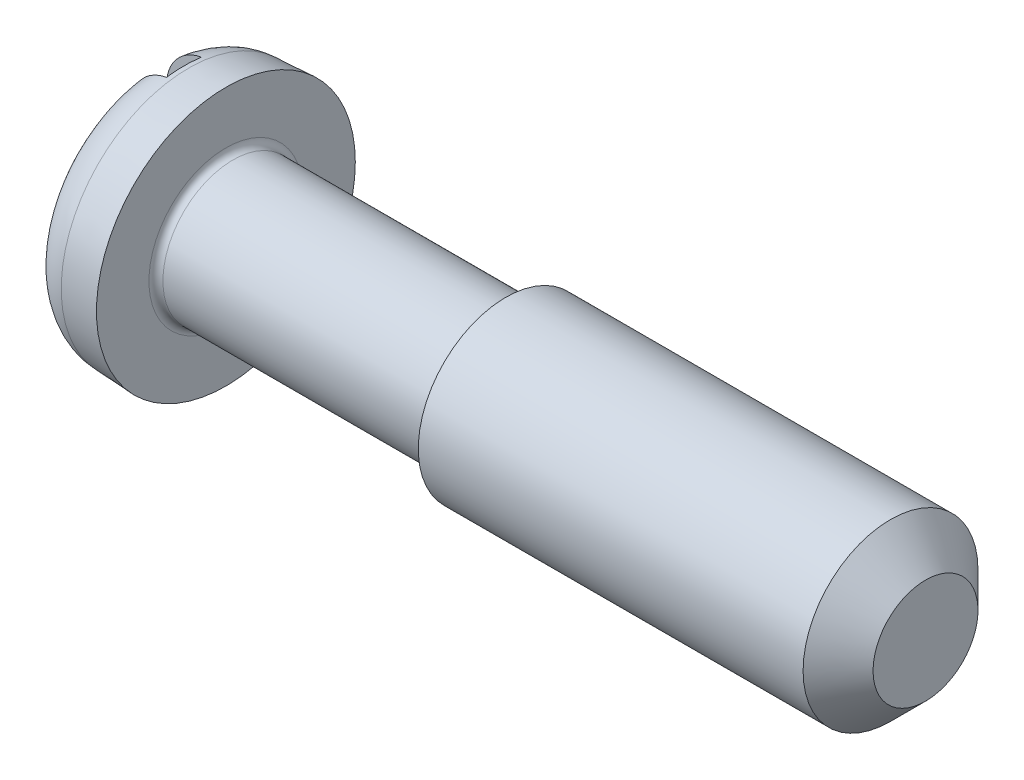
ISO-10303-21;
HEADER;
FILE_DESCRIPTION(('STEP AP214'),'2;1');
FILE_NAME('part.step','',(''),(''),'','','');
FILE_SCHEMA(('AUTOMOTIVE_DESIGN { 1 0 10303 214 1 1 1 1 }'));
ENDSEC;
DATA;
#1=APPLICATION_CONTEXT('core data for automotive mechanical design processes');
#2=APPLICATION_PROTOCOL_DEFINITION('international standard','automotive_design',2000,#1);
#3=PRODUCT_CONTEXT('',#1,'mechanical');
#4=PRODUCT('Part','Part','',(#3));
#5=PRODUCT_RELATED_PRODUCT_CATEGORY('part','',(#4));
#6=PRODUCT_DEFINITION_FORMATION('','',#4);
#7=PRODUCT_DEFINITION_CONTEXT('part definition',#1,'design');
#8=PRODUCT_DEFINITION('design','',#6,#7);
#9=PRODUCT_DEFINITION_SHAPE('','',#8);
#10=(LENGTH_UNIT() NAMED_UNIT(*) SI_UNIT(.MILLI.,.METRE.));
#11=(NAMED_UNIT(*) PLANE_ANGLE_UNIT() SI_UNIT($,.RADIAN.));
#12=(NAMED_UNIT(*) SI_UNIT($,.STERADIAN.) SOLID_ANGLE_UNIT());
#13=UNCERTAINTY_MEASURE_WITH_UNIT(LENGTH_MEASURE(1.E-05),#10,'distance_accuracy_value','');
#14=(GEOMETRIC_REPRESENTATION_CONTEXT(3) GLOBAL_UNCERTAINTY_ASSIGNED_CONTEXT((#13)) GLOBAL_UNIT_ASSIGNED_CONTEXT((#10,
#11,#12)) REPRESENTATION_CONTEXT('',''));
#15=CARTESIAN_POINT('',(0.,0.,0.));
#16=DIRECTION('',(0.,0.,1.));
#17=DIRECTION('',(1.,0.,0.));
#18=AXIS2_PLACEMENT_3D('',#15,#16,#17);
#19=CARTESIAN_POINT('',(11.1000000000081,0.,0.));
#20=DIRECTION('',(-1.,0.,0.));
#21=DIRECTION('',(0.,0.,1.));
#22=AXIS2_PLACEMENT_3D('',#19,#20,#21);
#23=CYLINDRICAL_SURFACE('',#22,1.);
#24=CARTESIAN_POINT('',(1.2,0.,0.));
#25=DIRECTION('',(1.,0.,0.));
#26=DIRECTION('',(0.,0.,-1.));
#27=AXIS2_PLACEMENT_3D('',#24,#25,#26);
#28=CIRCLE('',#27,1.);
#29=CARTESIAN_POINT('',(1.2,0.,-1.));
#30=VERTEX_POINT('',#29);
#31=EDGE_CURVE('E214',#30,#30,#28,.T.);
#32=ORIENTED_EDGE('',*,*,#31,.T.);
#33=EDGE_LOOP('',(#32));
#34=FACE_BOUND('',#33,.T.);
#35=CARTESIAN_POINT('',(4.999999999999,0.,0.));
#36=DIRECTION('',(1.,0.,0.));
#37=DIRECTION('',(0.,0.,-1.));
#38=AXIS2_PLACEMENT_3D('',#35,#36,#37);
#39=CIRCLE('',#38,1.);
#40=CARTESIAN_POINT('',(4.999999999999,0.,-1.));
#41=VERTEX_POINT('',#40);
#42=EDGE_CURVE('E209',#41,#41,#39,.F.);
#43=ORIENTED_EDGE('',*,*,#42,.T.);
#44=EDGE_LOOP('',(#43));
#45=FACE_BOUND('',#44,.T.);
#46=ADVANCED_FACE('F43',(#34,#45),#23,.T.);
#47=CARTESIAN_POINT('',(0.,0.,0.));
#48=DIRECTION('',(1.,0.,0.));
#49=DIRECTION('',(0.,0.,-1.));
#50=AXIS2_PLACEMENT_3D('',#47,#48,#49);
#51=PLANE('',#50);
#52=CARTESIAN_POINT('',(0.,0.,0.));
#53=DIRECTION('',(1.,0.,0.));
#54=DIRECTION('',(0.,0.,-1.));
#55=AXIS2_PLACEMENT_3D('',#52,#53,#54);
#56=CIRCLE('',#55,1.22297270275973);
#57=CARTESIAN_POINT('',(0.,-1.19714753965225,0.25));
#58=VERTEX_POINT('',#57);
#59=CARTESIAN_POINT('',(0.,1.19714753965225,0.25));
#60=VERTEX_POINT('',#59);
#61=EDGE_CURVE('E115',#58,#60,#56,.F.);
#62=ORIENTED_EDGE('',*,*,#61,.T.);
#63=DIRECTION('',(0.,1.,0.));
#64=VECTOR('',#63,1.);
#65=CARTESIAN_POINT('',(0.,-1.85,0.25));
#66=LINE('',#65,#64);
#67=EDGE_CURVE('E63',#58,#60,#66,.T.);
#68=ORIENTED_EDGE('',*,*,#67,.F.);
#69=EDGE_LOOP('',(#62,#68));
#70=FACE_BOUND('',#69,.T.);
#71=ADVANCED_FACE('F147',(#70),#51,.F.);
#72=CARTESIAN_POINT('',(1.1,0.,0.));
#73=DIRECTION('',(1.,0.,0.));
#74=DIRECTION('',(0.,0.,-1.));
#75=AXIS2_PLACEMENT_3D('',#72,#73,#74);
#76=PLANE('',#75);
#77=CARTESIAN_POINT('',(1.1,0.,0.));
#78=DIRECTION('',(1.,0.,0.));
#79=DIRECTION('',(0.,0.,-1.));
#80=AXIS2_PLACEMENT_3D('',#77,#78,#79);
#81=CIRCLE('',#80,1.1);
#82=CARTESIAN_POINT('',(1.1,0.,-1.1));
#83=VERTEX_POINT('',#82);
#84=EDGE_CURVE('E51',#83,#83,#81,.F.);
#85=ORIENTED_EDGE('',*,*,#84,.T.);
#86=EDGE_LOOP('',(#85));
#87=FACE_BOUND('',#86,.T.);
#88=CARTESIAN_POINT('',(1.1,0.,0.));
#89=DIRECTION('',(1.,0.,0.));
#90=DIRECTION('',(0.,0.,-1.));
#91=AXIS2_PLACEMENT_3D('',#88,#89,#90);
#92=CIRCLE('',#91,1.85);
#93=CARTESIAN_POINT('',(1.1,0.,-1.85));
#94=VERTEX_POINT('',#93);
#95=EDGE_CURVE('E119',#94,#94,#92,.T.);
#96=ORIENTED_EDGE('',*,*,#95,.T.);
#97=EDGE_LOOP('',(#96));
#98=FACE_BOUND('',#97,.T.);
#99=ADVANCED_FACE('F155',(#87,#98),#76,.T.);
#100=CARTESIAN_POINT('',(1.1,0.,0.));
#101=DIRECTION('',(1.,0.,0.));
#102=DIRECTION('',(0.,0.,-1.));
#103=AXIS2_PLACEMENT_3D('',#100,#101,#102);
#104=CONICAL_SURFACE('',#103,1.85,0.05235987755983);
#105=CARTESIAN_POINT('',(0.568598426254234,0.,0.));
#106=DIRECTION('',(1.,0.,0.));
#107=DIRECTION('',(0.,0.,-1.));
#108=AXIS2_PLACEMENT_3D('',#105,#106,#107);
#109=CIRCLE('',#108,1.82215042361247);
#110=CARTESIAN_POINT('',(0.568598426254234,0.,-1.82215042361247));
#111=VERTEX_POINT('',#110);
#112=EDGE_CURVE('E116',#111,#111,#109,.T.);
#113=ORIENTED_EDGE('',*,*,#112,.T.);
#114=EDGE_LOOP('',(#113));
#115=FACE_BOUND('',#114,.T.);
#116=ORIENTED_EDGE('',*,*,#95,.F.);
#117=EDGE_LOOP('',(#116));
#118=FACE_BOUND('',#117,.T.);
#119=ADVANCED_FACE('F164',(#115,#118),#104,.T.);
#120=CARTESIAN_POINT('',(0.,1.19714753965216,-0.25));
#121=VERTEX_POINT('',#120);
#122=CARTESIAN_POINT('',(0.,-1.19714753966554,-0.25));
#123=VERTEX_POINT('',#122);
#124=EDGE_CURVE('E114',#121,#123,#56,.F.);
#125=ORIENTED_EDGE('',*,*,#124,.T.);
#126=DIRECTION('',(0.,1.,0.));
#127=VECTOR('',#126,1.);
#128=CARTESIAN_POINT('',(0.,-1.85,-0.25));
#129=LINE('',#128,#127);
#130=EDGE_CURVE('E88',#123,#121,#129,.T.);
#131=ORIENTED_EDGE('',*,*,#130,.T.);
#132=EDGE_LOOP('',(#125,#131));
#133=FACE_BOUND('',#132,.T.);
#134=ADVANCED_FACE('F157',(#133),#51,.F.);
#135=CARTESIAN_POINT('',(0.6,0.,0.));
#136=DIRECTION('',(1.,0.,0.));
#137=DIRECTION('',(0.,0.,-1.));
#138=AXIS2_PLACEMENT_3D('',#135,#136,#137);
#139=TOROIDAL_SURFACE('',#138,1.22297270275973,0.6);
#140=CARTESIAN_POINT('',(0.277676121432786,-1.7108741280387,0.25));
#141=CARTESIAN_POINT('',(0.24920481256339,-1.6925458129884,0.25));
#142=CARTESIAN_POINT('',(0.222271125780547,-1.67177922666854,0.25));
#143=CARTESIAN_POINT('',(0.172264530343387,-1.62598662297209,0.25));
#144=CARTESIAN_POINT('',(0.149196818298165,-1.60095496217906,0.25));
#145=CARTESIAN_POINT('',(0.107602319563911,-1.54740517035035,0.25));
#146=CARTESIAN_POINT('',(0.0890710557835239,-1.51889051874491,0.25));
#147=CARTESIAN_POINT('',(0.0570138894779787,-1.4591876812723,0.25));
#148=CARTESIAN_POINT('',(0.0434867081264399,-1.42800018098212,0.25));
#149=CARTESIAN_POINT('',(0.0216547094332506,-1.36351517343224,0.25));
#150=CARTESIAN_POINT('',(0.0134012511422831,-1.33020029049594,0.25));
#151=CARTESIAN_POINT('',(0.00249748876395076,-1.26266597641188,0.25));
#152=CARTESIAN_POINT('',(-0.000152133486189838,-1.22844643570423,0.25));
#153=CARTESIAN_POINT('',(0.000168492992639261,-1.15941784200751,0.25));
#154=CARTESIAN_POINT('',(0.00324086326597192,-1.12460927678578,0.25));
#155=CARTESIAN_POINT('',(0.0150601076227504,-1.05597025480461,0.25));
#156=CARTESIAN_POINT('',(0.0238075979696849,-1.02213990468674,0.25));
#157=CARTESIAN_POINT('',(0.0469341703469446,-0.955656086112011,0.25));
#158=CARTESIAN_POINT('',(0.0614286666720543,-0.92304275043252,0.25));
#159=CARTESIAN_POINT('',(0.0956106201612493,-0.860656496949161,0.25));
#160=CARTESIAN_POINT('',(0.115298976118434,-0.830884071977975,0.25));
#161=CARTESIAN_POINT('',(0.159653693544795,-0.774618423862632,0.25));
#162=CARTESIAN_POINT('',(0.1843863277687,-0.74817735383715,0.25));
#163=CARTESIAN_POINT('',(0.23801750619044,-0.699905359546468,0.25));
#164=CARTESIAN_POINT('',(0.266916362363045,-0.678074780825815,0.25));
#165=CARTESIAN_POINT('',(0.327537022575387,-0.640227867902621,0.25));
#166=CARTESIAN_POINT('',(0.359193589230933,-0.624107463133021,0.25));
#167=CARTESIAN_POINT('',(0.424902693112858,-0.597880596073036,0.25));
#168=CARTESIAN_POINT('',(0.458953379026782,-0.587769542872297,0.25));
#169=CARTESIAN_POINT('',(0.52587483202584,-0.57464853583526,0.25));
#170=CARTESIAN_POINT('',(0.5586563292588,-0.571183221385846,0.25));
#171=CARTESIAN_POINT('',(0.624305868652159,-0.570167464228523,0.25));
#172=CARTESIAN_POINT('',(0.657173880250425,-0.572615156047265,0.25));
#173=CARTESIAN_POINT('',(0.72016913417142,-0.582973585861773,0.25));
#174=CARTESIAN_POINT('',(0.750347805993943,-0.590577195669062,0.25));
#175=CARTESIAN_POINT('',(0.80908254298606,-0.610548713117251,0.25));
#176=CARTESIAN_POINT('',(0.83763821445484,-0.622917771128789,0.25));
#177=CARTESIAN_POINT('',(0.893573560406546,-0.652503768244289,0.25));
#178=CARTESIAN_POINT('',(0.920861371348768,-0.669893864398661,0.25));
#179=CARTESIAN_POINT('',(0.972404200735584,-0.708698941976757,0.25));
#180=CARTESIAN_POINT('',(0.996658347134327,-0.730115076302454,0.25));
#181=CARTESIAN_POINT('',(1.04334267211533,-0.778139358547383,0.25));
#182=CARTESIAN_POINT('',(1.06549499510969,-0.805018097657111,0.25));
#183=CARTESIAN_POINT('',(1.10516996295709,-0.862001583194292,0.25));
#184=CARTESIAN_POINT('',(1.1226916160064,-0.892107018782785,0.25));
#185=CARTESIAN_POINT('',(1.15319618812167,-0.955916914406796,0.25));
#186=CARTESIAN_POINT('',(1.16598754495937,-0.989713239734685,0.25));
#187=CARTESIAN_POINT('',(1.18568560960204,-1.05898159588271,0.25));
#188=CARTESIAN_POINT('',(1.19259228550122,-1.0944536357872,0.25));
#189=CARTESIAN_POINT('',(1.20023971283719,-1.16588569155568,0.25));
#190=CARTESIAN_POINT('',(1.20101019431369,-1.20184250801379,0.25));
#191=CARTESIAN_POINT('',(1.19637006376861,-1.27335655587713,0.25));
#192=CARTESIAN_POINT('',(1.19096006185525,-1.30891382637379,0.25));
#193=CARTESIAN_POINT('',(1.17423093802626,-1.37783579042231,0.25));
#194=CARTESIAN_POINT('',(1.16303566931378,-1.41123054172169,0.25));
#195=CARTESIAN_POINT('',(1.13508454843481,-1.47560670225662,0.25));
#196=CARTESIAN_POINT('',(1.11832929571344,-1.50658837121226,0.25));
#197=CARTESIAN_POINT('',(1.0801023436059,-1.56460609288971,0.25));
#198=CARTESIAN_POINT('',(1.05873124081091,-1.59170844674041,0.25));
#199=CARTESIAN_POINT('',(1.01168085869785,-1.64187311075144,0.25));
#200=CARTESIAN_POINT('',(0.986001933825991,-1.66493575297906,0.25));
#201=CARTESIAN_POINT('',(0.931472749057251,-1.70601884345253,0.25));
#202=CARTESIAN_POINT('',(0.902674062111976,-1.72410776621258,0.25));
#203=CARTESIAN_POINT('',(0.842428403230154,-1.75514180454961,0.25));
#204=CARTESIAN_POINT('',(0.810981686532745,-1.76808741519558,0.25));
#205=CARTESIAN_POINT('',(0.74664239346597,-1.78835404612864,0.25));
#206=CARTESIAN_POINT('',(0.713765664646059,-1.795725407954,0.25));
#207=CARTESIAN_POINT('',(0.647230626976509,-1.80481985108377,0.25));
#208=CARTESIAN_POINT('',(0.613572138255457,-1.80654161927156,0.25));
#209=CARTESIAN_POINT('',(0.546573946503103,-1.80428809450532,0.25));
#210=CARTESIAN_POINT('',(0.513233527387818,-1.80033364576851,0.25));
#211=CARTESIAN_POINT('',(0.447720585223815,-1.78688285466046,0.25));
#212=CARTESIAN_POINT('',(0.415546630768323,-1.77739356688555,0.25));
#213=CARTESIAN_POINT('',(0.365768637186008,-1.75803965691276,0.25));
#214=CARTESIAN_POINT('',(0.347494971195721,-1.7498509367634,0.25));
#215=CARTESIAN_POINT('',(0.311860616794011,-1.73168330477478,0.25));
#216=CARTESIAN_POINT('',(0.294499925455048,-1.72170439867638,0.25));
#217=CARTESIAN_POINT('',(0.277676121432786,-1.7108741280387,0.25));
#218=B_SPLINE_CURVE_WITH_KNOTS('',3,(#140,#141,#142,#143,#144,#145,#146,#147,#148,#149,#150,
#151,#152,#153,#154,#155,#156,#157,#158,#159,#160,#161,#162,#163,#164,#165,#166,#167,#168,#169,
#170,#171,#172,#173,#174,#175,#176,#177,#178,#179,#180,#181,#182,#183,#184,#185,#186,#187,#188,
#189,#190,#191,#192,#193,#194,#195,#196,#197,#198,#199,#200,#201,#202,#203,#204,#205,#206,#207,
#208,#209,#210,#211,#212,#213,#214,#215,#216,#217),.UNSPECIFIED.,.T.,.F.,(4,2,2,2,2,2,2,2,2,2,2,
2,2,2,2,2,2,2,2,2,2,2,2,2,2,2,2,2,2,2,2,2,2,2,2,2,2,2,4),(0.,0.101507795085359,
0.203150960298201,0.3046934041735,0.406209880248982,0.508700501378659,0.611203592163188,
0.715553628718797,0.81991499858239,0.926487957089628,1.03307937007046,1.14117365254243,
1.24927603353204,1.35529231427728,1.46122749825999,1.55960100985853,1.65794349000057,
1.7508898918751,1.8438587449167,1.94052305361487,2.03721508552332,2.1412406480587,
2.2452884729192,2.35317968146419,2.46107147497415,2.56844020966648,2.67579834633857,
2.7809478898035,2.88608610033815,2.98913002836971,3.09216548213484,3.19370193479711,
3.29522861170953,3.39582706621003,3.49644890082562,3.59670217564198,3.69682794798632,
3.75680948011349,3.81679081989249),.UNSPECIFIED.);
#219=CARTESIAN_POINT('',(0.5,-1.79727656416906,0.25));
#220=VERTEX_POINT('',#219);
#221=EDGE_CURVE('E93',#220,#58,#218,.T.);
#222=ORIENTED_EDGE('',*,*,#221,.F.);
#223=CARTESIAN_POINT('',(0.5,0.,0.));
#224=DIRECTION('',(1.,0.,0.));
#225=DIRECTION('',(0.,0.,-1.));
#226=AXIS2_PLACEMENT_3D('',#223,#224,#225);
#227=CIRCLE('',#226,1.81458068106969);
#228=CARTESIAN_POINT('',(0.5,-1.79727656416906,-0.25));
#229=VERTEX_POINT('',#228);
#230=EDGE_CURVE('E96',#229,#220,#227,.F.);
#231=ORIENTED_EDGE('',*,*,#230,.F.);
#232=CARTESIAN_POINT('',(0.277676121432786,-1.7108741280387,-0.25));
#233=CARTESIAN_POINT('',(0.305813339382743,-1.72898372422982,-0.25));
#234=CARTESIAN_POINT('',(0.335493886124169,-1.74473941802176,-0.25));
#235=CARTESIAN_POINT('',(0.397102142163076,-1.7710602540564,-0.25));
#236=CARTESIAN_POINT('',(0.429032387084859,-1.78161942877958,-0.25));
#237=CARTESIAN_POINT('',(0.494206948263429,-1.79721592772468,-0.25));
#238=CARTESIAN_POINT('',(0.527450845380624,-1.80225499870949,-0.25));
#239=CARTESIAN_POINT('',(0.594303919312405,-1.8066649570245,-0.25));
#240=CARTESIAN_POINT('',(0.627913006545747,-1.80603720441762,-0.25));
#241=CARTESIAN_POINT('',(0.694477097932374,-1.79914331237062,-0.25));
#242=CARTESIAN_POINT('',(0.727433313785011,-1.79288886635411,-0.25));
#243=CARTESIAN_POINT('',(0.791830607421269,-1.77494158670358,-0.25));
#244=CARTESIAN_POINT('',(0.823271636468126,-1.7632485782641,-0.25));
#245=CARTESIAN_POINT('',(0.88378772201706,-1.73475063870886,-0.25));
#246=CARTESIAN_POINT('',(0.912860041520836,-1.71793989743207,-0.25));
#247=CARTESIAN_POINT('',(0.967789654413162,-1.67970176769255,-0.25));
#248=CARTESIAN_POINT('',(0.993646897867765,-1.65827430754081,-0.25));
#249=CARTESIAN_POINT('',(1.04157489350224,-1.61128968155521,-0.25));
#250=CARTESIAN_POINT('',(1.06362357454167,-1.58571000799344,-0.25));
#251=CARTESIAN_POINT('',(1.1031652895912,-1.53124501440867,-0.25));
#252=CARTESIAN_POINT('',(1.12065815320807,-1.50235957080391,-0.25));
#253=CARTESIAN_POINT('',(1.15079820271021,-1.44178348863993,-0.25));
#254=CARTESIAN_POINT('',(1.16339250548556,-1.41006654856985,-0.25));
#255=CARTESIAN_POINT('',(1.18316889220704,-1.34498962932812,-0.25));
#256=CARTESIAN_POINT('',(1.19035061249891,-1.31162953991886,-0.25));
#257=CARTESIAN_POINT('',(1.19922996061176,-1.24364908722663,-0.25));
#258=CARTESIAN_POINT('',(1.20083865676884,-1.20901712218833,-0.25));
#259=CARTESIAN_POINT('',(1.198341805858,-1.13996108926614,-0.25));
#260=CARTESIAN_POINT('',(1.19423567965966,-1.10553704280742,-0.25));
#261=CARTESIAN_POINT('',(1.18033724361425,-1.03712169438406,-0.25));
#262=CARTESIAN_POINT('',(1.17043013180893,-1.00315371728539,-0.25));
#263=CARTESIAN_POINT('',(1.14516284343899,-0.937309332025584,-0.25));
#264=CARTESIAN_POINT('',(1.12980194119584,-0.905433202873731,-0.25));
#265=CARTESIAN_POINT('',(1.09372107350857,-0.844045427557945,-0.25));
#266=CARTESIAN_POINT('',(1.07290425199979,-0.814590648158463,-0.25));
#267=CARTESIAN_POINT('',(1.02661450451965,-0.759585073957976,-0.25));
#268=CARTESIAN_POINT('',(1.00114061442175,-0.734035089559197,-0.25));
#269=CARTESIAN_POINT('',(0.946230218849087,-0.687703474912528,-0.25));
#270=CARTESIAN_POINT('',(0.916799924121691,-0.666914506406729,-0.25));
#271=CARTESIAN_POINT('',(0.854716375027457,-0.630881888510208,-0.25));
#272=CARTESIAN_POINT('',(0.822064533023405,-0.61563582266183,-0.25));
#273=CARTESIAN_POINT('',(0.756250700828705,-0.592093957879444,-0.25));
#274=CARTESIAN_POINT('',(0.72320388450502,-0.583477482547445,-0.25));
#275=CARTESIAN_POINT('',(0.656099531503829,-0.572433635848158,-0.25));
#276=CARTESIAN_POINT('',(0.622042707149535,-0.570002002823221,-0.25));
#277=CARTESIAN_POINT('',(0.556647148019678,-0.571420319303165,-0.25));
#278=CARTESIAN_POINT('',(0.525297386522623,-0.57480973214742,-0.25));
#279=CARTESIAN_POINT('',(0.463615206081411,-0.586808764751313,-0.25));
#280=CARTESIAN_POINT('',(0.433282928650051,-0.595419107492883,-0.25));
#281=CARTESIAN_POINT('',(0.374410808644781,-0.617444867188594,-0.25));
#282=CARTESIAN_POINT('',(0.345871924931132,-0.630862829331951,-0.25));
#283=CARTESIAN_POINT('',(0.291233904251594,-0.661976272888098,-0.25));
#284=CARTESIAN_POINT('',(0.265135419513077,-0.679672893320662,-0.25));
#285=CARTESIAN_POINT('',(0.214093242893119,-0.720236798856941,-0.25));
#286=CARTESIAN_POINT('',(0.189375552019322,-0.743388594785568,-0.25));
#287=CARTESIAN_POINT('',(0.143913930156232,-0.79331215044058,-0.25));
#288=CARTESIAN_POINT('',(0.123171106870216,-0.820084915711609,-0.25));
#289=CARTESIAN_POINT('',(0.0850905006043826,-0.878167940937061,-0.25));
#290=CARTESIAN_POINT('',(0.0680135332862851,-0.909649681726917,-0.25));
#291=CARTESIAN_POINT('',(0.0393283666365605,-0.975015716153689,-0.25));
#292=CARTESIAN_POINT('',(0.0277206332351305,-1.0089002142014,-0.25));
#293=CARTESIAN_POINT('',(0.0102640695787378,-1.07846233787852,-0.25));
#294=CARTESIAN_POINT('',(0.0044698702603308,-1.11415372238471,-0.25));
#295=CARTESIAN_POINT('',(-0.000932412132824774,-1.186002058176,-0.25));
#296=CARTESIAN_POINT('',(-0.000541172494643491,-1.22215895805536,-0.25));
#297=CARTESIAN_POINT('',(0.00642355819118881,-1.29324796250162,-0.25));
#298=CARTESIAN_POINT('',(0.0128910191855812,-1.32819043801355,-0.25));
#299=CARTESIAN_POINT('',(0.0317325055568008,-1.39645666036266,-0.25));
#300=CARTESIAN_POINT('',(0.0441073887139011,-1.42978017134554,-0.25));
#301=CARTESIAN_POINT('',(0.0741258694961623,-1.49311241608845,-0.25));
#302=CARTESIAN_POINT('',(0.0916548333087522,-1.52317557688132,-0.25));
#303=CARTESIAN_POINT('',(0.131582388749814,-1.57983451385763,-0.25));
#304=CARTESIAN_POINT('',(0.153974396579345,-1.60643490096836,-0.25));
#305=CARTESIAN_POINT('',(0.193523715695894,-1.64594051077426,-0.25));
#306=CARTESIAN_POINT('',(0.209376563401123,-1.66017509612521,-0.25));
#307=CARTESIAN_POINT('',(0.24250348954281,-1.68688198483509,-0.25));
#308=CARTESIAN_POINT('',(0.259777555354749,-1.69935430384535,-0.25));
#309=CARTESIAN_POINT('',(0.277676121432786,-1.7108741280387,-0.25));
#310=B_SPLINE_CURVE_WITH_KNOTS('',3,(#232,#233,#234,#235,#236,#237,#238,#239,#240,#241,#242,
#243,#244,#245,#246,#247,#248,#249,#250,#251,#252,#253,#254,#255,#256,#257,#258,#259,#260,#261,
#262,#263,#264,#265,#266,#267,#268,#269,#270,#271,#272,#273,#274,#275,#276,#277,#278,#279,#280,
#281,#282,#283,#284,#285,#286,#287,#288,#289,#290,#291,#292,#293,#294,#295,#296,#297,#298,#299,
#300,#301,#302,#303,#304,#305,#306,#307,#308,#309),.UNSPECIFIED.,.T.,.F.,(4,2,2,2,2,2,2,2,2,2,2,
2,2,2,2,2,2,2,2,2,2,2,2,2,2,2,2,2,2,2,2,2,2,2,2,2,2,2,4),(0.,0.100306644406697,
0.200728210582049,0.301117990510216,0.401483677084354,0.501641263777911,0.601802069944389,
0.70207701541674,0.802353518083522,0.903192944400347,1.00403614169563,1.10593964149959,
1.2078499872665,1.31137926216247,1.41491902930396,1.52058062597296,1.62625628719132,
1.73395260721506,1.8416712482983,1.94922272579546,2.05672725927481,2.158631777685,
2.26046605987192,2.3546094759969,2.44876593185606,2.54297230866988,2.63720379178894,
2.73836380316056,2.83955196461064,2.94649618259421,3.05344950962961,3.1613987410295,
3.2693361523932,3.37542436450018,3.48152798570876,3.5854303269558,3.68919286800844,
3.75300020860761,3.81680698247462),.UNSPECIFIED.);
#311=EDGE_CURVE('E84',#123,#229,#310,.T.);
#312=ORIENTED_EDGE('',*,*,#311,.F.);
#313=ORIENTED_EDGE('',*,*,#124,.F.);
#314=CARTESIAN_POINT('',(0.426797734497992,0.598391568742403,-0.25));
#315=CARTESIAN_POINT('',(0.45652344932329,0.588679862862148,-0.25));
#316=CARTESIAN_POINT('',(0.487061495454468,0.58140262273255,-0.25));
#317=CARTESIAN_POINT('',(0.548939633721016,0.572098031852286,-0.25));
#318=CARTESIAN_POINT('',(0.580279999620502,0.570072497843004,-0.25));
#319=CARTESIAN_POINT('',(0.642848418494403,0.571389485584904,-0.25));
#320=CARTESIAN_POINT('',(0.674076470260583,0.574732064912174,-0.25));
#321=CARTESIAN_POINT('',(0.735527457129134,0.586598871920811,-0.25));
#322=CARTESIAN_POINT('',(0.765750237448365,0.595123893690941,-0.25));
#323=CARTESIAN_POINT('',(0.824539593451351,0.616987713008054,-0.25));
#324=CARTESIAN_POINT('',(0.853098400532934,0.630347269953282,-0.25));
#325=CARTESIAN_POINT('',(0.907784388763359,0.661348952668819,-0.25));
#326=CARTESIAN_POINT('',(0.933910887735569,0.678992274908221,-0.25));
#327=CARTESIAN_POINT('',(0.985012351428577,0.719446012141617,-0.25));
#328=CARTESIAN_POINT('',(1.0097627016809,0.742540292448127,-0.25));
#329=CARTESIAN_POINT('',(1.05529935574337,0.792353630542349,-0.25));
#330=CARTESIAN_POINT('',(1.07608457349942,0.819073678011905,-0.25));
#331=CARTESIAN_POINT('',(1.11426764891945,0.877062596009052,-0.25));
#332=CARTESIAN_POINT('',(1.13140393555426,0.908504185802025,-0.25));
#333=CARTESIAN_POINT('',(1.16021506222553,0.973799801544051,-0.25));
#334=CARTESIAN_POINT('',(1.17188943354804,1.00765403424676,-0.25));
#335=CARTESIAN_POINT('',(1.18948787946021,1.07717452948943,-0.25));
#336=CARTESIAN_POINT('',(1.19535604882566,1.11285499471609,-0.25));
#337=CARTESIAN_POINT('',(1.20090787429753,1.18469567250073,-0.25));
#338=CARTESIAN_POINT('',(1.20059196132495,1.22085585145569,-0.25));
#339=CARTESIAN_POINT('',(1.19377441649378,1.29197115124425,-0.25));
#340=CARTESIAN_POINT('',(1.18737770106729,1.32693630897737,-0.25));
#341=CARTESIAN_POINT('',(1.1686751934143,1.39524998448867,-0.25));
#342=CARTESIAN_POINT('',(1.15637006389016,1.42859868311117,-0.25));
#343=CARTESIAN_POINT('',(1.12648932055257,1.49197896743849,-0.25));
#344=CARTESIAN_POINT('',(1.10903122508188,1.52206597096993,-0.25));
#345=CARTESIAN_POINT('',(1.06922913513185,1.5788137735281,-0.25));
#346=CARTESIAN_POINT('',(1.04688561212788,1.60547490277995,-0.25));
#347=CARTESIAN_POINT('',(0.998361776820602,1.65414184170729,-0.25));
#348=CARTESIAN_POINT('',(0.97225282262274,1.67621882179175,-0.25));
#349=CARTESIAN_POINT('',(0.916663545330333,1.71561621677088,-0.25));
#350=CARTESIAN_POINT('',(0.887183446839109,1.73293694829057,-0.25));
#351=CARTESIAN_POINT('',(0.826048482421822,1.76213371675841,-0.25));
#352=CARTESIAN_POINT('',(0.794421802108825,1.77406879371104,-0.25));
#353=CARTESIAN_POINT('',(0.729606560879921,1.79242313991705,-0.25));
#354=CARTESIAN_POINT('',(0.696418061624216,1.79884262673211,-0.25));
#355=CARTESIAN_POINT('',(0.629638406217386,1.80595266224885,-0.25));
#356=CARTESIAN_POINT('',(0.596050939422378,1.80667790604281,-0.25));
#357=CARTESIAN_POINT('',(0.529232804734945,1.80246957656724,-0.25));
#358=CARTESIAN_POINT('',(0.496002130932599,1.79753609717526,-0.25));
#359=CARTESIAN_POINT('',(0.430892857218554,1.78216805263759,-0.25));
#360=CARTESIAN_POINT('',(0.399012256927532,1.77174195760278,-0.25));
#361=CARTESIAN_POINT('',(0.337447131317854,1.74569993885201,-0.25));
#362=CARTESIAN_POINT('',(0.307762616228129,1.7300839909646,-0.25));
#363=CARTESIAN_POINT('',(0.25133719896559,1.69406665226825,-0.25));
#364=CARTESIAN_POINT('',(0.22460484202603,1.67365187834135,-0.25));
#365=CARTESIAN_POINT('',(0.174916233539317,1.62865427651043,-0.25));
#366=CARTESIAN_POINT('',(0.151960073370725,1.60407134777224,-0.25));
#367=CARTESIAN_POINT('',(0.110285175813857,1.55124702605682,-0.25));
#368=CARTESIAN_POINT('',(0.0915991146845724,1.52297986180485,-0.25));
#369=CARTESIAN_POINT('',(0.0591713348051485,1.46374064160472,-0.25));
#370=CARTESIAN_POINT('',(0.0454298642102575,1.43276844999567,-0.25));
#371=CARTESIAN_POINT('',(0.0230869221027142,1.3685877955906,-0.25));
#372=CARTESIAN_POINT('',(0.0145519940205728,1.33535617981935,-0.25));
#373=CARTESIAN_POINT('',(0.00307666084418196,1.26794218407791,-0.25));
#374=CARTESIAN_POINT('',(0.000136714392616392,1.23375972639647,-0.25));
#375=CARTESIAN_POINT('',(-0.00012973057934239,1.16476167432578,-0.25));
#376=CARTESIAN_POINT('',(0.0026452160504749,1.12994570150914,-0.25));
#377=CARTESIAN_POINT('',(0.0138749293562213,1.061244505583,-0.25));
#378=CARTESIAN_POINT('',(0.0223300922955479,1.02735934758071,-0.25));
#379=CARTESIAN_POINT('',(0.0448765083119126,0.960721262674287,-0.25));
#380=CARTESIAN_POINT('',(0.0590827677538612,0.928007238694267,-0.25));
#381=CARTESIAN_POINT('',(0.0927111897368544,0.865363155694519,-0.25));
#382=CARTESIAN_POINT('',(0.112135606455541,0.835434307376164,-0.25));
#383=CARTESIAN_POINT('',(0.156002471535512,0.77878291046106,-0.25));
#384=CARTESIAN_POINT('',(0.180516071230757,0.752115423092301,-0.25));
#385=CARTESIAN_POINT('',(0.233725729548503,0.703378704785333,-0.25));
#386=CARTESIAN_POINT('',(0.262416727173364,0.681303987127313,-0.25));
#387=CARTESIAN_POINT('',(0.3137167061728,0.648618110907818,-0.25));
#388=CARTESIAN_POINT('',(0.33542798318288,0.636579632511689,-0.25));
#389=CARTESIAN_POINT('',(0.380188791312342,0.615315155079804,-0.25));
#390=CARTESIAN_POINT('',(0.403238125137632,0.606088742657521,-0.25));
#391=CARTESIAN_POINT('',(0.426797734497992,0.598391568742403,-0.25));
#392=B_SPLINE_CURVE_WITH_KNOTS('',3,(#314,#315,#316,#317,#318,#319,#320,#321,#322,#323,#324,
#325,#326,#327,#328,#329,#330,#331,#332,#333,#334,#335,#336,#337,#338,#339,#340,#341,#342,#343,
#344,#345,#346,#347,#348,#349,#350,#351,#352,#353,#354,#355,#356,#357,#358,#359,#360,#361,#362,
#363,#364,#365,#366,#367,#368,#369,#370,#371,#372,#373,#374,#375,#376,#377,#378,#379,#380,#381,
#382,#383,#384,#385,#386,#387,#388,#389,#390,#391),.UNSPECIFIED.,.T.,.F.,(4,2,2,2,2,2,2,2,2,2,2,
2,2,2,2,2,2,2,2,2,2,2,2,2,2,2,2,2,2,2,2,2,2,2,2,2,2,2,4),(0.,0.0937298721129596,
0.187492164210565,0.281255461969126,0.375033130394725,0.469218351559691,0.563429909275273,
0.66454400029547,0.765685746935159,0.872609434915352,0.979542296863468,1.08749502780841,
1.19544023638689,1.3015561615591,1.40766018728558,1.51151016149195,1.615350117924,
1.71743213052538,1.81950734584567,1.92043463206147,2.02135793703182,2.12166583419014,
2.22197206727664,2.32212406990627,2.42227653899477,2.5227117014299,2.62314929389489,
2.72433149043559,2.82551876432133,2.92797357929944,3.03043679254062,3.13473449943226,
3.23903948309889,3.34554232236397,3.45209124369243,3.56024443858,3.66826767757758,
3.74256577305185,3.81685294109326),.UNSPECIFIED.);
#393=CARTESIAN_POINT('',(0.5,1.79727656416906,-0.25));
#394=VERTEX_POINT('',#393);
#395=EDGE_CURVE('E106',#394,#121,#392,.T.);
#396=ORIENTED_EDGE('',*,*,#395,.F.);
#397=CARTESIAN_POINT('',(0.5,1.79727656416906,0.25));
#398=VERTEX_POINT('',#397);
#399=EDGE_CURVE('E100',#398,#394,#227,.F.);
#400=ORIENTED_EDGE('',*,*,#399,.F.);
#401=CARTESIAN_POINT('',(0.426797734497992,0.598391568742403,0.25));
#402=CARTESIAN_POINT('',(0.394332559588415,0.609001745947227,0.25));
#403=CARTESIAN_POINT('',(0.362786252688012,0.622533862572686,0.25));
#404=CARTESIAN_POINT('',(0.302426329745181,0.654792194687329,0.25));
#405=CARTESIAN_POINT('',(0.273618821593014,0.673529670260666,0.25));
#406=CARTESIAN_POINT('',(0.219567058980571,0.715410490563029,0.25));
#407=CARTESIAN_POINT('',(0.194311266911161,0.738538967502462,0.25));
#408=CARTESIAN_POINT('',(0.147843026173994,0.788526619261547,0.25));
#409=CARTESIAN_POINT('',(0.126629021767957,0.815384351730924,0.25));
#410=CARTESIAN_POINT('',(0.0878809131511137,0.87339989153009,0.25));
#411=CARTESIAN_POINT('',(0.0705539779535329,0.904696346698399,0.25));
#412=CARTESIAN_POINT('',(0.041331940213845,0.969735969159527,0.25));
#413=CARTESIAN_POINT('',(0.0294377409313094,1.00347954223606,0.25));
#414=CARTESIAN_POINT('',(0.0113648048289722,1.07285167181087,0.25));
#415=CARTESIAN_POINT('',(0.00524801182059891,1.10849642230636,0.25));
#416=CARTESIAN_POINT('',(-0.000805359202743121,1.18030868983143,0.25));
#417=CARTESIAN_POINT('',(-0.000742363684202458,1.21647617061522,0.25));
#418=CARTESIAN_POINT('',(0.00557779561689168,1.28765936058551,0.25));
#419=CARTESIAN_POINT('',(0.0117316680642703,1.32268421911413,0.25));
#420=CARTESIAN_POINT('',(0.0299625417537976,1.39115787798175,0.25));
#421=CARTESIAN_POINT('',(0.0420388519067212,1.42460686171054,0.25));
#422=CARTESIAN_POINT('',(0.071487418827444,1.48822188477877,0.25));
#423=CARTESIAN_POINT('',(0.0887415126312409,1.51844263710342,0.25));
#424=CARTESIAN_POINT('',(0.128162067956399,1.57549045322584,0.25));
#425=CARTESIAN_POINT('',(0.150328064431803,1.60231783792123,0.25));
#426=CARTESIAN_POINT('',(0.198528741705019,1.65133862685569,0.25));
#427=CARTESIAN_POINT('',(0.224491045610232,1.67360321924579,0.25));
#428=CARTESIAN_POINT('',(0.279821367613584,1.71339741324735,0.25));
#429=CARTESIAN_POINT('',(0.309189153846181,1.73092733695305,0.25));
#430=CARTESIAN_POINT('',(0.370134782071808,1.7605535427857,0.25));
#431=CARTESIAN_POINT('',(0.401683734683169,1.77270927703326,0.25));
#432=CARTESIAN_POINT('',(0.466382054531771,1.79151432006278,0.25));
#433=CARTESIAN_POINT('',(0.499531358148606,1.7981638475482,0.25));
#434=CARTESIAN_POINT('',(0.566268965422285,1.80573464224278,0.25));
#435=CARTESIAN_POINT('',(0.599853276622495,1.80669114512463,0.25));
#436=CARTESIAN_POINT('',(0.666703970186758,1.80294204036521,0.25));
#437=CARTESIAN_POINT('',(0.699970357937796,1.79823652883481,0.25));
#438=CARTESIAN_POINT('',(0.765185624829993,1.78331475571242,0.25));
#439=CARTESIAN_POINT('',(0.797136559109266,1.77310747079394,0.25));
#440=CARTESIAN_POINT('',(0.858877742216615,1.74748773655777,0.25));
#441=CARTESIAN_POINT('',(0.888667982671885,1.73207526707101,0.25));
#442=CARTESIAN_POINT('',(0.945334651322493,1.69644589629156,0.25));
#443=CARTESIAN_POINT('',(0.972202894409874,1.6762159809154,0.25));
#444=CARTESIAN_POINT('',(1.02219178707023,1.63156244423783,0.25));
#445=CARTESIAN_POINT('',(1.0453123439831,1.60713871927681,0.25));
#446=CARTESIAN_POINT('',(1.08733867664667,1.5546065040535,0.25));
#447=CARTESIAN_POINT('',(1.10621238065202,1.52647236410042,0.25));
#448=CARTESIAN_POINT('',(1.13903428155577,1.4674660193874,0.25));
#449=CARTESIAN_POINT('',(1.15298224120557,1.43659368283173,0.25));
#450=CARTESIAN_POINT('',(1.17575231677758,1.37258162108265,0.25));
#451=CARTESIAN_POINT('',(1.18450861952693,1.33941849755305,0.25));
#452=CARTESIAN_POINT('',(1.19643431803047,1.27210410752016,0.25));
#453=CARTESIAN_POINT('',(1.19960327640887,1.23795276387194,0.25));
#454=CARTESIAN_POINT('',(1.2003330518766,1.16898362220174,0.25));
#455=CARTESIAN_POINT('',(1.19779314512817,1.13416477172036,0.25));
#456=CARTESIAN_POINT('',(1.18702967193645,1.06541786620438,0.25));
#457=CARTESIAN_POINT('',(1.17880547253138,1.03148991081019,0.25));
#458=CARTESIAN_POINT('',(1.1567146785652,0.964724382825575,0.25));
#459=CARTESIAN_POINT('',(1.1427323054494,0.931925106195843,0.25));
#460=CARTESIAN_POINT('',(1.10954073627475,0.869082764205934,0.25));
#461=CARTESIAN_POINT('',(1.09033064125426,0.83904017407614,0.25));
#462=CARTESIAN_POINT('',(1.04687831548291,0.782125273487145,0.25));
#463=CARTESIAN_POINT('',(1.02256542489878,0.755306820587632,0.25));
#464=CARTESIAN_POINT('',(0.969713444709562,0.706202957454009,0.25));
#465=CARTESIAN_POINT('',(0.941174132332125,0.683917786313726,0.25));
#466=CARTESIAN_POINT('',(0.88112723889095,0.6450496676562,0.25));
#467=CARTESIAN_POINT('',(0.849678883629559,0.628375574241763,0.25));
#468=CARTESIAN_POINT('',(0.784275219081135,0.600994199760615,0.25));
#469=CARTESIAN_POINT('',(0.750321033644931,0.590284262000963,0.25));
#470=CARTESIAN_POINT('',(0.683401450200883,0.575978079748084,0.25));
#471=CARTESIAN_POINT('',(0.650530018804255,0.571941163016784,0.25));
#472=CARTESIAN_POINT('',(0.584631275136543,0.569839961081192,0.25));
#473=CARTESIAN_POINT('',(0.551604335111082,0.571765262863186,0.25));
#474=CARTESIAN_POINT('',(0.503395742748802,0.578915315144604,0.25));
#475=CARTESIAN_POINT('',(0.487851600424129,0.58190806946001,0.25));
#476=CARTESIAN_POINT('',(0.457071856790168,0.589188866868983,0.25));
#477=CARTESIAN_POINT('',(0.441836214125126,0.593476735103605,0.25));
#478=CARTESIAN_POINT('',(0.426797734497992,0.598391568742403,0.25));
#479=B_SPLINE_CURVE_WITH_KNOTS('',3,(#401,#402,#403,#404,#405,#406,#407,#408,#409,#410,#411,
#412,#413,#414,#415,#416,#417,#418,#419,#420,#421,#422,#423,#424,#425,#426,#427,#428,#429,#430,
#431,#432,#433,#434,#435,#436,#437,#438,#439,#440,#441,#442,#443,#444,#445,#446,#447,#448,#449,
#450,#451,#452,#453,#454,#455,#456,#457,#458,#459,#460,#461,#462,#463,#464,#465,#466,#467,#468,
#469,#470,#471,#472,#473,#474,#475,#476,#477,#478),.UNSPECIFIED.,.T.,.F.,(4,2,2,2,2,2,2,2,2,2,2,
2,2,2,2,2,2,2,2,2,2,2,2,2,2,2,2,2,2,2,2,2,2,2,2,2,2,2,4),(0.,0.102402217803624,
0.205027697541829,0.30731169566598,0.409556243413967,0.51637643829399,0.623214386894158,
0.731185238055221,0.83914863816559,0.945311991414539,1.05146295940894,1.15535509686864,
1.25923740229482,1.36134914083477,1.46345393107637,1.56439905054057,1.66534016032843,
1.76565586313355,1.86596986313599,1.96612068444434,2.06627189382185,2.16669678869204,
2.26712416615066,2.3682862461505,2.46945319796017,2.57187661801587,2.67430805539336,
2.77856089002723,2.88282533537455,2.98929735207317,3.09578768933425,3.20386343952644,
3.31194488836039,3.41817476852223,3.52435729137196,3.62319781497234,3.72186581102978,
3.76930684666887,3.81674147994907),.UNSPECIFIED.);
#480=EDGE_CURVE('E108',#60,#398,#479,.T.);
#481=ORIENTED_EDGE('',*,*,#480,.F.);
#482=ORIENTED_EDGE('',*,*,#61,.F.);
#483=EDGE_LOOP('',(#222,#231,#312,#313,#396,#400,#481,#482));
#484=FACE_BOUND('',#483,.T.);
#485=ORIENTED_EDGE('',*,*,#112,.F.);
#486=EDGE_LOOP('',(#485));
#487=FACE_BOUND('',#486,.T.);
#488=ADVANCED_FACE('F102',(#484,#487),#139,.T.);
#489=CARTESIAN_POINT('',(0.,-1.85,0.25));
#490=DIRECTION('',(0.,0.,1.));
#491=DIRECTION('',(1.,0.,0.));
#492=AXIS2_PLACEMENT_3D('',#489,#490,#491);
#493=PLANE('',#492);
#494=ORIENTED_EDGE('',*,*,#221,.T.);
#495=ORIENTED_EDGE('',*,*,#67,.T.);
#496=ORIENTED_EDGE('',*,*,#480,.T.);
#497=DIRECTION('',(0.,1.,0.));
#498=VECTOR('',#497,1.);
#499=CARTESIAN_POINT('',(0.5,-1.85,0.25));
#500=LINE('',#499,#498);
#501=EDGE_CURVE('E59',#220,#398,#500,.T.);
#502=ORIENTED_EDGE('',*,*,#501,.F.);
#503=EDGE_LOOP('',(#494,#495,#496,#502));
#504=FACE_BOUND('',#503,.T.);
#505=ADVANCED_FACE('F173',(#504),#493,.F.);
#506=CARTESIAN_POINT('',(0.,-1.85,-0.25));
#507=DIRECTION('',(0.,0.,-1.));
#508=DIRECTION('',(-1.,0.,0.));
#509=AXIS2_PLACEMENT_3D('',#506,#507,#508);
#510=PLANE('',#509);
#511=ORIENTED_EDGE('',*,*,#311,.T.);
#512=DIRECTION('',(0.,1.,0.));
#513=VECTOR('',#512,1.);
#514=CARTESIAN_POINT('',(0.5,-1.85,-0.25));
#515=LINE('',#514,#513);
#516=EDGE_CURVE('E90',#229,#394,#515,.T.);
#517=ORIENTED_EDGE('',*,*,#516,.T.);
#518=ORIENTED_EDGE('',*,*,#395,.T.);
#519=ORIENTED_EDGE('',*,*,#130,.F.);
#520=EDGE_LOOP('',(#511,#517,#518,#519));
#521=FACE_BOUND('',#520,.T.);
#522=ADVANCED_FACE('F87',(#521),#510,.F.);
#523=CARTESIAN_POINT('',(0.5,-1.85,0.25));
#524=DIRECTION('',(1.,0.,0.));
#525=DIRECTION('',(0.,0.,-1.));
#526=AXIS2_PLACEMENT_3D('',#523,#524,#525);
#527=PLANE('',#526);
#528=ORIENTED_EDGE('',*,*,#230,.T.);
#529=ORIENTED_EDGE('',*,*,#501,.T.);
#530=ORIENTED_EDGE('',*,*,#399,.T.);
#531=ORIENTED_EDGE('',*,*,#516,.F.);
#532=EDGE_LOOP('',(#528,#529,#530,#531));
#533=FACE_BOUND('',#532,.T.);
#534=ADVANCED_FACE('F99',(#533),#527,.F.);
#535=CARTESIAN_POINT('',(5.099999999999,0.,0.));
#536=DIRECTION('',(1.,0.,0.));
#537=DIRECTION('',(0.,0.,-1.));
#538=AXIS2_PLACEMENT_3D('',#535,#536,#537);
#539=PLANE('',#538);
#540=CARTESIAN_POINT('',(5.099999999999,0.,0.));
#541=DIRECTION('',(1.,0.,0.));
#542=DIRECTION('',(0.,0.,-1.));
#543=AXIS2_PLACEMENT_3D('',#540,#541,#542);
#544=CIRCLE('',#543,1.1);
#545=CARTESIAN_POINT('',(5.099999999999,0.,-1.1));
#546=VERTEX_POINT('',#545);
#547=EDGE_CURVE('E11',#546,#546,#544,.T.);
#548=ORIENTED_EDGE('',*,*,#547,.T.);
#549=EDGE_LOOP('',(#548));
#550=FACE_BOUND('',#549,.T.);
#551=CARTESIAN_POINT('',(5.099999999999,0.,0.));
#552=DIRECTION('',(1.,0.,0.));
#553=DIRECTION('',(0.,0.,-1.));
#554=AXIS2_PLACEMENT_3D('',#551,#552,#553);
#555=CIRCLE('',#554,1.25);
#556=CARTESIAN_POINT('',(5.099999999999,0.,-1.25));
#557=VERTEX_POINT('',#556);
#558=EDGE_CURVE('E123',#557,#557,#555,.T.);
#559=ORIENTED_EDGE('',*,*,#558,.F.);
#560=EDGE_LOOP('',(#559));
#561=FACE_BOUND('',#560,.T.);
#562=ADVANCED_FACE('F135',(#550,#561),#539,.F.);
#563=CARTESIAN_POINT('',(5.099999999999,0.,0.));
#564=DIRECTION('',(1.,0.,0.));
#565=DIRECTION('',(0.,0.,-1.));
#566=AXIS2_PLACEMENT_3D('',#563,#564,#565);
#567=CYLINDRICAL_SURFACE('',#566,1.25);
#568=CARTESIAN_POINT('',(10.599999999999,0.,0.));
#569=DIRECTION('',(1.,0.,0.));
#570=DIRECTION('',(0.,0.,-1.));
#571=AXIS2_PLACEMENT_3D('',#568,#569,#570);
#572=CIRCLE('',#571,1.25);
#573=CARTESIAN_POINT('',(10.599999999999,0.,1.25));
#574=VERTEX_POINT('',#573);
#575=EDGE_CURVE('E203',#574,#574,#572,.F.);
#576=ORIENTED_EDGE('',*,*,#575,.T.);
#577=EDGE_LOOP('',(#576));
#578=FACE_BOUND('',#577,.T.);
#579=ORIENTED_EDGE('',*,*,#558,.T.);
#580=EDGE_LOOP('',(#579));
#581=FACE_BOUND('',#580,.T.);
#582=ADVANCED_FACE('F129',(#578,#581),#567,.T.);
#583=CARTESIAN_POINT('',(11.1000000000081,0.,0.));
#584=DIRECTION('',(1.,0.,0.));
#585=DIRECTION('',(0.,0.,-1.));
#586=AXIS2_PLACEMENT_3D('',#583,#584,#585);
#587=PLANE('',#586);
#588=CARTESIAN_POINT('',(11.1000000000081,0.,0.));
#589=DIRECTION('',(1.,0.,0.));
#590=DIRECTION('',(0.,0.,-1.));
#591=AXIS2_PLACEMENT_3D('',#588,#589,#590);
#592=CIRCLE('',#591,0.749999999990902);
#593=CARTESIAN_POINT('',(11.1000000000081,0.,0.749999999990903));
#594=VERTEX_POINT('',#593);
#595=EDGE_CURVE('E205',#594,#594,#592,.T.);
#596=ORIENTED_EDGE('',*,*,#595,.T.);
#597=EDGE_LOOP('',(#596));
#598=FACE_BOUND('',#597,.T.);
#599=ADVANCED_FACE('F142',(#598),#587,.T.);
#600=CARTESIAN_POINT('',(11.1000000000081,0.,0.));
#601=DIRECTION('',(-1.,0.,0.));
#602=DIRECTION('',(0.,0.,1.));
#603=AXIS2_PLACEMENT_3D('',#600,#601,#602);
#604=CONICAL_SURFACE('',#603,0.749999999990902,0.785398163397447);
#605=CARTESIAN_POINT('',(10.599999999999,0.,1.25));
#606=CARTESIAN_POINT('',(10.6052083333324,0.,1.24479166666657));
#607=CARTESIAN_POINT('',(10.6104166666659,0.,1.23958333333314));
#608=CARTESIAN_POINT('',(10.6208333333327,0.,1.22916666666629));
#609=CARTESIAN_POINT('',(10.6260416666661,0.,1.22395833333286));
#610=CARTESIAN_POINT('',(10.636458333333,0.,1.213541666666));
#611=CARTESIAN_POINT('',(10.6416666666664,0.,1.20833333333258));
#612=CARTESIAN_POINT('',(10.6520833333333,0.,1.19791666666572));
#613=CARTESIAN_POINT('',(10.6572916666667,0.,1.19270833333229));
#614=CARTESIAN_POINT('',(10.6677083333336,0.,1.18229166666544));
#615=CARTESIAN_POINT('',(10.672916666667,0.,1.17708333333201));
#616=CARTESIAN_POINT('',(10.6833333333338,0.,1.16666666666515));
#617=CARTESIAN_POINT('',(10.6885416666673,0.,1.16145833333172));
#618=CARTESIAN_POINT('',(10.6989583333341,0.,1.15104166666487));
#619=CARTESIAN_POINT('',(10.7041666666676,0.,1.14583333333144));
#620=CARTESIAN_POINT('',(10.7145833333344,0.,1.13541666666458));
#621=CARTESIAN_POINT('',(10.7197916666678,0.,1.13020833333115));
#622=CARTESIAN_POINT('',(10.7302083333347,0.,1.1197916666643));
#623=CARTESIAN_POINT('',(10.7354166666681,0.,1.11458333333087));
#624=CARTESIAN_POINT('',(10.745833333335,0.,1.10416666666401));
#625=CARTESIAN_POINT('',(10.7510416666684,0.,1.09895833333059));
#626=CARTESIAN_POINT('',(10.7614583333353,0.,1.08854166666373));
#627=CARTESIAN_POINT('',(10.7666666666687,0.,1.0833333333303));
#628=CARTESIAN_POINT('',(10.7770833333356,0.,1.07291666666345));
#629=CARTESIAN_POINT('',(10.782291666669,0.,1.06770833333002));
#630=CARTESIAN_POINT('',(10.7927083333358,0.,1.05729166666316));
#631=CARTESIAN_POINT('',(10.7979166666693,0.,1.05208333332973));
#632=CARTESIAN_POINT('',(10.8083333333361,0.,1.04166666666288));
#633=CARTESIAN_POINT('',(10.8135416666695,0.,1.03645833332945));
#634=CARTESIAN_POINT('',(10.8239583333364,0.,1.02604166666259));
#635=CARTESIAN_POINT('',(10.8291666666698,0.,1.02083333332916));
#636=CARTESIAN_POINT('',(10.8395833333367,0.,1.01041666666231));
#637=CARTESIAN_POINT('',(10.8447916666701,0.,1.00520833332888));
#638=CARTESIAN_POINT('',(10.855208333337,0.,0.994791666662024));
#639=CARTESIAN_POINT('',(10.8604166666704,0.,0.989583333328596));
#640=CARTESIAN_POINT('',(10.8708333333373,0.,0.97916666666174));
#641=CARTESIAN_POINT('',(10.8760416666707,0.,0.973958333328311));
#642=CARTESIAN_POINT('',(10.8864583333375,0.,0.963541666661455));
#643=CARTESIAN_POINT('',(10.891666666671,0.,0.958333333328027));
#644=CARTESIAN_POINT('',(10.9020833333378,0.,0.947916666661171));
#645=CARTESIAN_POINT('',(10.9072916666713,0.,0.942708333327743));
#646=CARTESIAN_POINT('',(10.9177083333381,0.,0.932291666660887));
#647=CARTESIAN_POINT('',(10.9229166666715,0.,0.927083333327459));
#648=CARTESIAN_POINT('',(10.9333333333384,0.,0.916666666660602));
#649=CARTESIAN_POINT('',(10.9385416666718,0.,0.911458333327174));
#650=CARTESIAN_POINT('',(10.9489583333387,0.,0.901041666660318));
#651=CARTESIAN_POINT('',(10.9541666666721,0.,0.89583333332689));
#652=CARTESIAN_POINT('',(10.964583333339,0.,0.885416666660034));
#653=CARTESIAN_POINT('',(10.9697916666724,0.,0.880208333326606));
#654=CARTESIAN_POINT('',(10.9802083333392,0.,0.869791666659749));
#655=CARTESIAN_POINT('',(10.9854166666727,0.,0.864583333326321));
#656=CARTESIAN_POINT('',(10.9958333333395,0.,0.854166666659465));
#657=CARTESIAN_POINT('',(11.001041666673,0.,0.848958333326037));
#658=CARTESIAN_POINT('',(11.0114583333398,0.,0.838541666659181));
#659=CARTESIAN_POINT('',(11.0166666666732,0.,0.833333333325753));
#660=CARTESIAN_POINT('',(11.0270833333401,0.,0.822916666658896));
#661=CARTESIAN_POINT('',(11.0322916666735,0.,0.817708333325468));
#662=CARTESIAN_POINT('',(11.0427083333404,0.,0.807291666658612));
#663=CARTESIAN_POINT('',(11.0479166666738,0.,0.802083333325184));
#664=CARTESIAN_POINT('',(11.0583333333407,0.,0.791666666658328));
#665=CARTESIAN_POINT('',(11.0635416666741,0.,0.7864583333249));
#666=CARTESIAN_POINT('',(11.073958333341,0.,0.776041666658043));
#667=CARTESIAN_POINT('',(11.0791666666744,0.,0.770833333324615));
#668=CARTESIAN_POINT('',(11.0895833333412,0.,0.760416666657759));
#669=CARTESIAN_POINT('',(11.0947916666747,0.,0.755208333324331));
#670=CARTESIAN_POINT('',(11.1000000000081,0.,0.749999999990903));
#671=B_SPLINE_CURVE_WITH_KNOTS('',3,(#605,#606,#607,#608,#609,#610,#611,#612,#613,#614,#615,
#616,#617,#618,#619,#620,#621,#622,#623,#624,#625,#626,#627,#628,#629,#630,#631,#632,#633,#634,
#635,#636,#637,#638,#639,#640,#641,#642,#643,#644,#645,#646,#647,#648,#649,#650,#651,#652,#653,
#654,#655,#656,#657,#658,#659,#660,#661,#662,#663,#664,#665,#666,#667,#668,#669,#670),
.UNSPECIFIED.,.F.,.F.,(4,2,2,2,2,2,2,2,2,2,2,2,2,2,2,2,2,2,2,2,2,2,2,2,2,2,2,2,2,2,2,2,4),(0.,
0.0220970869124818,0.0441941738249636,0.0662912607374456,0.0883883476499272,0.110485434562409,
0.132582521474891,0.154679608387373,0.176776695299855,0.198873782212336,0.220970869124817,
0.243067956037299,0.265165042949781,0.287262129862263,0.309359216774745,0.331456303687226,
0.353553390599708,0.37565047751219,0.397747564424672,0.419844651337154,0.441941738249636,
0.464038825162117,0.486135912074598,0.50823299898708,0.530330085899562,0.552427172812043,
0.574524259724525,0.596621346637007,0.618718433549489,0.64081552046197,0.662912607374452,
0.685009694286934,0.707106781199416),.UNSPECIFIED.);
#672=EDGE_CURVE('BSEAM175',#574,#594,#671,.T.);
#673=ORIENTED_EDGE('',*,*,#575,.F.);
#674=ORIENTED_EDGE('',*,*,#595,.F.);
#675=ORIENTED_EDGE('',*,*,#672,.T.);
#676=ORIENTED_EDGE('',*,*,#672,.F.);
#677=EDGE_LOOP('',(#673,#675,#674,#676));
#678=FACE_BOUND('',#677,.T.);
#679=ADVANCED_FACE('F175',(#678),#604,.T.);
#680=CARTESIAN_POINT('',(1.2,0.,0.));
#681=DIRECTION('',(1.,0.,0.));
#682=DIRECTION('',(0.,0.,-1.));
#683=AXIS2_PLACEMENT_3D('',#680,#681,#682);
#684=TOROIDAL_SURFACE('',#683,1.1,0.1);
#685=ORIENTED_EDGE('',*,*,#84,.F.);
#686=EDGE_LOOP('',(#685));
#687=FACE_BOUND('',#686,.T.);
#688=ORIENTED_EDGE('',*,*,#31,.F.);
#689=EDGE_LOOP('',(#688));
#690=FACE_BOUND('',#689,.T.);
#691=ADVANCED_FACE('F218',(#687,#690),#684,.F.);
#692=CARTESIAN_POINT('',(4.999999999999,0.,0.));
#693=DIRECTION('',(1.,0.,0.));
#694=DIRECTION('',(0.,0.,-1.));
#695=AXIS2_PLACEMENT_3D('',#692,#693,#694);
#696=TOROIDAL_SURFACE('',#695,1.1,0.1);
#697=ORIENTED_EDGE('',*,*,#42,.F.);
#698=EDGE_LOOP('',(#697));
#699=FACE_BOUND('',#698,.T.);
#700=ORIENTED_EDGE('',*,*,#547,.F.);
#701=EDGE_LOOP('',(#700));
#702=FACE_BOUND('',#701,.T.);
#703=ADVANCED_FACE('F44',(#699,#702),#696,.F.);
#704=CLOSED_SHELL('',(#46,#71,#99,#119,#134,#488,#505,#522,#534,#562,#582,#599,#679,#691,#703));
#705=MANIFOLD_SOLID_BREP('B2',#704);
#706=ADVANCED_BREP_SHAPE_REPRESENTATION('',(#18,#705),#14);
#707=SHAPE_DEFINITION_REPRESENTATION(#9,#706);
ENDSEC;
END-ISO-10303-21;
